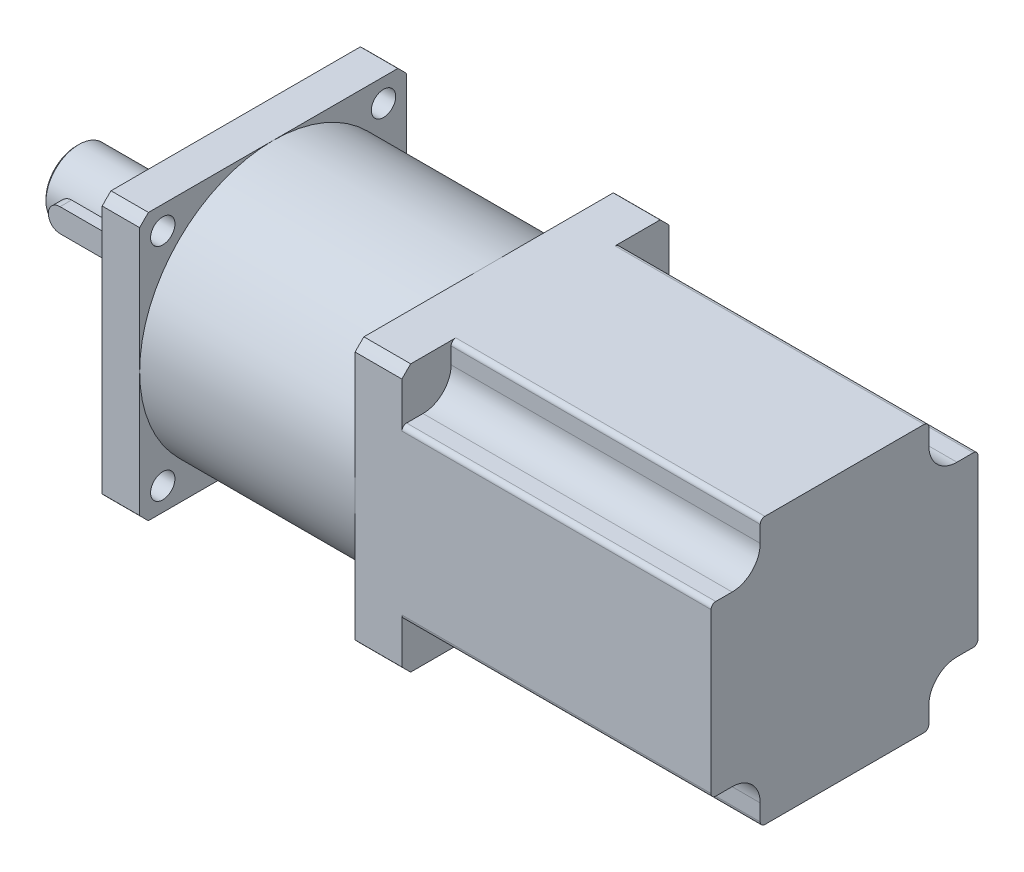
from build123d import *

# Parameters (mm, degrees)
ESQUISSE2_W                              = 31.5
ESQUISSE2_H                              = 7
BOSS_EXTRU_1_DEPTH                       = 9
CHANFREIN1_SIZE                          = 0.5
DIAM_TRE_DU_PER_AGE_5_2_5_2_1_AT_2_COUNT = 2
DIAM_TRE_DU_PER_AGE_5_2_5_2_1_AT_2_PITCH = 47.14
DIAM_TRE_DU_PER_AGE_5_2_5_2_1_AT_3_COUNT = 2
DIAM_TRE_DU_PER_AGE_5_2_5_2_1_AT_3_PITCH = 66.66602733
DIAM_TRE_DU_PER_AGE_5_2_5_2_1_AT_4_COUNT = 2
DIAM_TRE_DU_PER_AGE_5_2_5_2_1_AT_4_PITCH = 47.14
ESQUISSE6_OUTSIDE_W                      = 119.53
ESQUISSE6_OUTSIDE_H                      = 119.53
ESQUISSE6_OUTSIDE_W_2                    = 57
ESQUISSE6_OUTSIDE_H_2                    = 57
ENL_V_MAT_EXTRU_1_DEPTH                  = 142.216146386
ENL_V_MAT_EXTRU_2_DEPTH                  = 66
CONG_1_R                                 = 1


with BuildPart() as part:
    # Esquisse1 → R_volution1 (revolve)
    with BuildSketch(Plane.XY, mode=Mode.PRIVATE) as r_volution1_sk:
        Polygon((-2.5, 0), (-2.5, 20), (0, 20), (0, 39), (8, 39), (8, 28.5), (54, 28.5), (54, 39), (130, 39), (130, 0), align=None)
    revolve(r_volution1_sk.sketch.rotate(Axis((-41.073505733, 0, 0), (1, 0, 0)), 90), axis=Axis((-41.073505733, 0, 0), (1, 0, 0)))

    # Esquisse5 → Diam_tre du per_age _5.2 _5.2_1 (revolve, cut)
    with BuildSketch(Plane(origin=(0, 23.57, -23.57), x_dir=(0, 0, 1), z_dir=(0, 1, 0))):
        Polygon((0, 0), (0, 11.662237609), (2.6, 10.1), (2.6, 0), align=None)
    diam_tre_du_per_age_5_2_5_2_1 = revolve(axis=Axis((-6.35, 23.57, -23.57), (1, 0, 0)), mode=Mode.SUBTRACT)

    # Diam_tre du per_age _5.2 _5.2_1 at 2: Diam_tre du per_age _5.2 _5.2_1 ×2
    with Locations(*[(0, 0, i * DIAM_TRE_DU_PER_AGE_5_2_5_2_1_AT_2_PITCH) for i in range(1, DIAM_TRE_DU_PER_AGE_5_2_5_2_1_AT_2_COUNT)]):
        add(diam_tre_du_per_age_5_2_5_2_1, mode=Mode.SUBTRACT)

    # Diam_tre du per_age _5.2 _5.2_1 at 3: Diam_tre du per_age _5.2 _5.2_1 ×2
    with Locations(*[Vector(0, -0.7071067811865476, 0.7071067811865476) * (i * DIAM_TRE_DU_PER_AGE_5_2_5_2_1_AT_3_PITCH) for i in range(1, DIAM_TRE_DU_PER_AGE_5_2_5_2_1_AT_3_COUNT)]):
        add(diam_tre_du_per_age_5_2_5_2_1, mode=Mode.SUBTRACT)

    # Diam_tre du per_age _5.2 _5.2_1 at 4: Diam_tre du per_age _5.2 _5.2_1 ×2
    with Locations(*[(0, -i * DIAM_TRE_DU_PER_AGE_5_2_5_2_1_AT_4_PITCH, 0) for i in range(1, DIAM_TRE_DU_PER_AGE_5_2_5_2_1_AT_4_COUNT)]):
        add(diam_tre_du_per_age_5_2_5_2_1, mode=Mode.SUBTRACT)

    # Esquisse6 outside → Enl_v. mat.-Extru.1 (cut, through all)
    with BuildSketch(Plane.ZY):
        Rectangle(ESQUISSE6_OUTSIDE_W, ESQUISSE6_OUTSIDE_H)
        Rectangle(ESQUISSE6_OUTSIDE_W_2, ESQUISSE6_OUTSIDE_H_2, mode=Mode.SUBTRACT)
    extrude(amount=-ENL_V_MAT_EXTRU_1_DEPTH, mode=Mode.SUBTRACT)

    # Esquisse7 → Enl_v. mat.-Extru.2 (cut)
    with BuildSketch(Plane(origin=(130, 0, 0), x_dir=(0, 0, -1), z_dir=(1, 0, 0))):
        with BuildLine():
            Line((-28.5, 28.5), (-18, 28.5))
            Line((-18, 28.5), (-18, 24))
            ThreePointArc((-18, 24), (-19.757359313, 19.757359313), (-24, 18))
            Line((-24, 18), (-28.5, 18))
            Line((-28.5, 18), (-28.5, 28.5))
        make_face()
        with BuildLine():
            Line((18, 28.5), (28.5, 28.5))
            Line((28.5, 28.5), (28.5, 18))
            Line((28.5, 18), (24, 18))
            ThreePointArc((24, 18), (19.757359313, 19.757359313), (18, 24))
            Line((18, 24), (18, 28.5))
        make_face()
        with BuildLine():
            Line((-28.5, -18), (-24, -18))
            ThreePointArc((-24, -18), (-19.757359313, -19.757359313), (-18, -24))
            Line((-18, -24), (-18, -28.5))
            Line((-18, -28.5), (-28.5, -28.5))
            Line((-28.5, -28.5), (-28.5, -18))
        make_face()
        with BuildLine():
            Line((24, -18), (28.5, -18))
            Line((28.5, -18), (28.5, -28.5))
            Line((28.5, -28.5), (18, -28.5))
            Line((18, -28.5), (18, -24))
            ThreePointArc((18, -24), (19.757359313, -19.757359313), (24, -18))
        make_face()
    extrude(amount=-ENL_V_MAT_EXTRU_2_DEPTH, mode=Mode.SUBTRACT)

    # Cong_1
    cong_1_edges = [part.edges().sort_by_distance(p)[0] for p in [
        (97, 28.5, -18),
        (97, 18, -28.5),
        (97, -28.5, 18),
        (97, -18, 28.5),
        (97, -18, -28.5),
        (97, -28.5, -18),
        (97, 18, 28.5),
        (97, 28.5, 18),
    ]]
    fillet(cong_1_edges, radius=CONG_1_R)


with BuildPart() as body_2:
    # Esquisse2 → R_volution2 (revolve)
    with BuildSketch(Plane.XY, mode=Mode.PRIVATE) as r_volution2_sk:
        with Locations((-18.25, 3.5)):
            Rectangle(ESQUISSE2_W, ESQUISSE2_H)
    revolve(r_volution2_sk.sketch.rotate(Axis((-41.224518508, 0, 0), (1, 0, 0)), 180), axis=Axis((-41.224518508, 0, 0), (1, 0, 0)))

    # Chanfrein1
    chanfrein1_edges = [body_2.edges().sort_by_distance(p)[0] for p in [
        (-34, 7, 0),
    ]]
    chamfer(chanfrein1_edges, length=CHANFREIN1_SIZE)


with BuildPart() as body_3:
    # Esquisse3 → Boss.-Extru.1 (new body)
    with BuildSketch(Plane.XY):
        with BuildLine():
            Line((-28.5, 2.5), (-8.5, 2.5))
            ThreePointArc((-8.5, 2.5), (-6, 0), (-8.5, -2.5))
            Line((-8.5, -2.5), (-28.5, -2.5))
            ThreePointArc((-28.5, -2.5), (-31, 0), (-28.5, 2.5))
        make_face()
    extrude(amount=BOSS_EXTRU_1_DEPTH)


solid = Compound([part.part, body_2.part, body_3.part])
